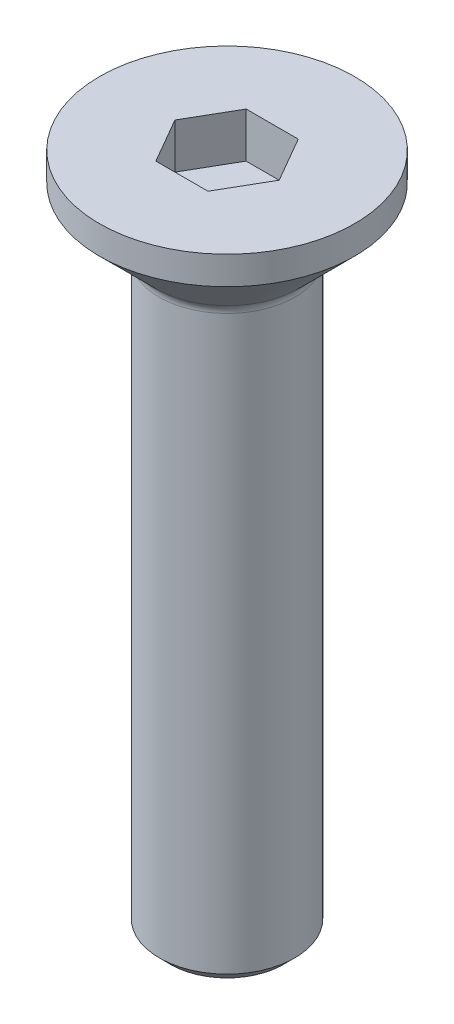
ISO-10303-21;
HEADER;
FILE_DESCRIPTION(('STEP AP214'),'2;1');
FILE_NAME('part.step','',(''),(''),'','','');
FILE_SCHEMA(('AUTOMOTIVE_DESIGN { 1 0 10303 214 1 1 1 1 }'));
ENDSEC;
DATA;
#1=APPLICATION_CONTEXT('core data for automotive mechanical design processes');
#2=APPLICATION_PROTOCOL_DEFINITION('international standard','automotive_design',2000,#1);
#3=PRODUCT_CONTEXT('',#1,'mechanical');
#4=PRODUCT('Part','Part','',(#3));
#5=PRODUCT_RELATED_PRODUCT_CATEGORY('part','',(#4));
#6=PRODUCT_DEFINITION_FORMATION('','',#4);
#7=PRODUCT_DEFINITION_CONTEXT('part definition',#1,'design');
#8=PRODUCT_DEFINITION('design','',#6,#7);
#9=PRODUCT_DEFINITION_SHAPE('','',#8);
#10=(LENGTH_UNIT() NAMED_UNIT(*) SI_UNIT(.MILLI.,.METRE.));
#11=(NAMED_UNIT(*) PLANE_ANGLE_UNIT() SI_UNIT($,.RADIAN.));
#12=(NAMED_UNIT(*) SI_UNIT($,.STERADIAN.) SOLID_ANGLE_UNIT());
#13=UNCERTAINTY_MEASURE_WITH_UNIT(LENGTH_MEASURE(1.E-05),#10,'distance_accuracy_value','');
#14=(GEOMETRIC_REPRESENTATION_CONTEXT(3) GLOBAL_UNCERTAINTY_ASSIGNED_CONTEXT((#13)) GLOBAL_UNIT_ASSIGNED_CONTEXT((#10,
#11,#12)) REPRESENTATION_CONTEXT('',''));
#15=CARTESIAN_POINT('',(0.,0.,0.));
#16=DIRECTION('',(0.,0.,1.));
#17=DIRECTION('',(1.,0.,0.));
#18=AXIS2_PLACEMENT_3D('',#15,#16,#17);
#19=CARTESIAN_POINT('',(0.,-4.14852813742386,0.));
#20=DIRECTION('',(0.,1.,0.));
#21=DIRECTION('',(-1.,0.,0.));
#22=AXIS2_PLACEMENT_3D('',#19,#20,#21);
#23=TOROIDAL_SURFACE('',#22,3.6,0.6);
#24=CARTESIAN_POINT('',(0.,-3.72426406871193,0.));
#25=DIRECTION('',(0.,1.,0.));
#26=DIRECTION('',(-1.,0.,0.));
#27=AXIS2_PLACEMENT_3D('',#24,#25,#26);
#28=CIRCLE('',#27,3.17573593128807);
#29=CARTESIAN_POINT('',(-3.17573593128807,-3.72426406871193,0.));
#30=VERTEX_POINT('',#29);
#31=EDGE_CURVE('E11',#30,#30,#28,.T.);
#32=ORIENTED_EDGE('',*,*,#31,.F.);
#33=EDGE_LOOP('',(#32));
#34=FACE_BOUND('',#33,.T.);
#35=CARTESIAN_POINT('',(0.,-4.14852813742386,0.));
#36=DIRECTION('',(0.,1.,0.));
#37=DIRECTION('',(-1.,0.,0.));
#38=AXIS2_PLACEMENT_3D('',#35,#36,#37);
#39=CIRCLE('',#38,3.);
#40=CARTESIAN_POINT('',(-3.,-4.14852813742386,0.));
#41=VERTEX_POINT('',#40);
#42=EDGE_CURVE('E138',#41,#41,#39,.T.);
#43=ORIENTED_EDGE('',*,*,#42,.T.);
#44=EDGE_LOOP('',(#43));
#45=FACE_BOUND('',#44,.T.);
#46=ADVANCED_FACE('F37',(#34,#45),#23,.F.);
#47=CARTESIAN_POINT('',(0.,-3.72426406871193,0.));
#48=DIRECTION('',(0.,1.,0.));
#49=DIRECTION('',(-1.,0.,0.));
#50=AXIS2_PLACEMENT_3D('',#47,#48,#49);
#51=CONICAL_SURFACE('',#50,3.17573593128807,0.78539816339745);
#52=CARTESIAN_POINT('',(0.,-1.25000000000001,0.));
#53=DIRECTION('',(0.,1.,0.));
#54=DIRECTION('',(-1.,0.,0.));
#55=AXIS2_PLACEMENT_3D('',#52,#53,#54);
#56=CIRCLE('',#55,5.65);
#57=CARTESIAN_POINT('',(-5.65,-1.25000000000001,0.));
#58=VERTEX_POINT('',#57);
#59=EDGE_CURVE('E44',#58,#58,#56,.T.);
#60=ORIENTED_EDGE('',*,*,#59,.F.);
#61=EDGE_LOOP('',(#60));
#62=FACE_BOUND('',#61,.T.);
#63=ORIENTED_EDGE('',*,*,#31,.T.);
#64=EDGE_LOOP('',(#63));
#65=FACE_BOUND('',#64,.T.);
#66=ADVANCED_FACE('F159',(#62,#65),#51,.T.);
#67=CARTESIAN_POINT('',(0.,0.,0.));
#68=DIRECTION('',(0.,1.,0.));
#69=DIRECTION('',(-1.,0.,0.));
#70=AXIS2_PLACEMENT_3D('',#67,#68,#69);
#71=CYLINDRICAL_SURFACE('',#70,5.65);
#72=CARTESIAN_POINT('',(0.,0.,0.));
#73=DIRECTION('',(0.,1.,0.));
#74=DIRECTION('',(-1.,0.,0.));
#75=AXIS2_PLACEMENT_3D('',#72,#73,#74);
#76=CIRCLE('',#75,5.65);
#77=CARTESIAN_POINT('',(-5.65,0.,0.));
#78=VERTEX_POINT('',#77);
#79=EDGE_CURVE('E152',#78,#78,#76,.T.);
#80=ORIENTED_EDGE('',*,*,#79,.F.);
#81=EDGE_LOOP('',(#80));
#82=FACE_BOUND('',#81,.T.);
#83=ORIENTED_EDGE('',*,*,#59,.T.);
#84=EDGE_LOOP('',(#83));
#85=FACE_BOUND('',#84,.T.);
#86=ADVANCED_FACE('F157',(#82,#85),#71,.T.);
#87=CARTESIAN_POINT('',(5.65,0.,0.));
#88=DIRECTION('',(0.,-1.,0.));
#89=DIRECTION('',(1.,0.,0.));
#90=AXIS2_PLACEMENT_3D('',#87,#88,#89);
#91=PLANE('',#90);
#92=DIRECTION('',(-0.5,0.,-0.866025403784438));
#93=VECTOR('',#92,1.);
#94=CARTESIAN_POINT('',(2.3094010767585,0.,0.));
#95=LINE('',#94,#93);
#96=CARTESIAN_POINT('',(2.3094010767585,0.,0.));
#97=VERTEX_POINT('',#96);
#98=CARTESIAN_POINT('',(1.15470053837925,0.,-2.));
#99=VERTEX_POINT('',#98);
#100=EDGE_CURVE('E125',#97,#99,#95,.T.);
#101=ORIENTED_EDGE('',*,*,#100,.F.);
#102=DIRECTION('',(0.5,0.,-0.866025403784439));
#103=VECTOR('',#102,1.);
#104=CARTESIAN_POINT('',(1.15470053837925,0.,2.));
#105=LINE('',#104,#103);
#106=CARTESIAN_POINT('',(1.15470053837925,0.,2.));
#107=VERTEX_POINT('',#106);
#108=EDGE_CURVE('E51',#107,#97,#105,.T.);
#109=ORIENTED_EDGE('',*,*,#108,.F.);
#110=DIRECTION('',(1.,0.,0.));
#111=VECTOR('',#110,1.);
#112=CARTESIAN_POINT('',(-1.15470053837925,0.,2.));
#113=LINE('',#112,#111);
#114=CARTESIAN_POINT('',(-1.15470053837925,0.,2.));
#115=VERTEX_POINT('',#114);
#116=EDGE_CURVE('E134',#115,#107,#113,.T.);
#117=ORIENTED_EDGE('',*,*,#116,.F.);
#118=DIRECTION('',(0.5,0.,0.866025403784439));
#119=VECTOR('',#118,1.);
#120=CARTESIAN_POINT('',(-2.3094010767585,0.,0.));
#121=LINE('',#120,#119);
#122=CARTESIAN_POINT('',(-2.3094010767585,0.,0.));
#123=VERTEX_POINT('',#122);
#124=EDGE_CURVE('E132',#123,#115,#121,.T.);
#125=ORIENTED_EDGE('',*,*,#124,.F.);
#126=DIRECTION('',(-0.5,0.,0.866025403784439));
#127=VECTOR('',#126,1.);
#128=CARTESIAN_POINT('',(-1.15470053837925,0.,-2.));
#129=LINE('',#128,#127);
#130=CARTESIAN_POINT('',(-1.15470053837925,0.,-2.));
#131=VERTEX_POINT('',#130);
#132=EDGE_CURVE('E99',#131,#123,#129,.T.);
#133=ORIENTED_EDGE('',*,*,#132,.F.);
#134=DIRECTION('',(-1.,0.,0.));
#135=VECTOR('',#134,1.);
#136=CARTESIAN_POINT('',(1.15470053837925,0.,-2.));
#137=LINE('',#136,#135);
#138=EDGE_CURVE('E128',#99,#131,#137,.T.);
#139=ORIENTED_EDGE('',*,*,#138,.F.);
#140=EDGE_LOOP('',(#101,#109,#117,#125,#133,#139));
#141=FACE_BOUND('',#140,.T.);
#142=ORIENTED_EDGE('',*,*,#79,.T.);
#143=EDGE_LOOP('',(#142));
#144=FACE_BOUND('',#143,.T.);
#145=ADVANCED_FACE('F183',(#141,#144),#91,.F.);
#146=CARTESIAN_POINT('',(2.5,-30.,0.));
#147=DIRECTION('',(0.,1.,0.));
#148=DIRECTION('',(-1.,0.,0.));
#149=AXIS2_PLACEMENT_3D('',#146,#147,#148);
#150=PLANE('',#149);
#151=CARTESIAN_POINT('',(0.,-30.,0.));
#152=DIRECTION('',(0.,1.,0.));
#153=DIRECTION('',(-1.,0.,0.));
#154=AXIS2_PLACEMENT_3D('',#151,#152,#153);
#155=CIRCLE('',#154,2.5);
#156=CARTESIAN_POINT('',(-2.5,-30.,0.));
#157=VERTEX_POINT('',#156);
#158=EDGE_CURVE('E149',#157,#157,#155,.T.);
#159=ORIENTED_EDGE('',*,*,#158,.F.);
#160=EDGE_LOOP('',(#159));
#161=FACE_BOUND('',#160,.T.);
#162=ADVANCED_FACE('F178',(#161),#150,.F.);
#163=CARTESIAN_POINT('',(0.,-30.,0.));
#164=DIRECTION('',(0.,1.,0.));
#165=DIRECTION('',(-1.,0.,0.));
#166=AXIS2_PLACEMENT_3D('',#163,#164,#165);
#167=CONICAL_SURFACE('',#166,2.5,0.785398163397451);
#168=CARTESIAN_POINT('',(0.,-29.5,0.));
#169=DIRECTION('',(0.,1.,0.));
#170=DIRECTION('',(-1.,0.,0.));
#171=AXIS2_PLACEMENT_3D('',#168,#169,#170);
#172=CIRCLE('',#171,3.);
#173=CARTESIAN_POINT('',(-3.,-29.5,0.));
#174=VERTEX_POINT('',#173);
#175=EDGE_CURVE('E146',#174,#174,#172,.T.);
#176=ORIENTED_EDGE('',*,*,#175,.F.);
#177=EDGE_LOOP('',(#176));
#178=FACE_BOUND('',#177,.T.);
#179=ORIENTED_EDGE('',*,*,#158,.T.);
#180=EDGE_LOOP('',(#179));
#181=FACE_BOUND('',#180,.T.);
#182=ADVANCED_FACE('F172',(#178,#181),#167,.T.);
#183=CARTESIAN_POINT('',(0.,0.,0.));
#184=DIRECTION('',(0.,1.,0.));
#185=DIRECTION('',(-1.,0.,0.));
#186=AXIS2_PLACEMENT_3D('',#183,#184,#185);
#187=CYLINDRICAL_SURFACE('',#186,3.);
#188=ORIENTED_EDGE('',*,*,#42,.F.);
#189=EDGE_LOOP('',(#188));
#190=FACE_BOUND('',#189,.T.);
#191=ORIENTED_EDGE('',*,*,#175,.T.);
#192=EDGE_LOOP('',(#191));
#193=FACE_BOUND('',#192,.T.);
#194=ADVANCED_FACE('F168',(#190,#193),#187,.T.);
#195=CARTESIAN_POINT('',(1.15470053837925,-2.,2.));
#196=DIRECTION('',(0.866025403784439,0.,0.5));
#197=DIRECTION('',(0.5,0.,-0.866025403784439));
#198=AXIS2_PLACEMENT_3D('',#195,#196,#197);
#199=PLANE('',#198);
#200=ORIENTED_EDGE('',*,*,#108,.T.);
#201=DIRECTION('',(0.,1.,0.));
#202=VECTOR('',#201,1.);
#203=CARTESIAN_POINT('',(2.3094010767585,-2.,0.));
#204=LINE('',#203,#202);
#205=CARTESIAN_POINT('',(2.3094010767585,-2.,0.));
#206=VERTEX_POINT('',#205);
#207=EDGE_CURVE('E81',#206,#97,#204,.T.);
#208=ORIENTED_EDGE('',*,*,#207,.F.);
#209=DIRECTION('',(0.5,0.,-0.866025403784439));
#210=VECTOR('',#209,1.);
#211=CARTESIAN_POINT('',(1.15470053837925,-2.,2.));
#212=LINE('',#211,#210);
#213=CARTESIAN_POINT('',(1.15470053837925,-2.,2.));
#214=VERTEX_POINT('',#213);
#215=EDGE_CURVE('E136',#214,#206,#212,.T.);
#216=ORIENTED_EDGE('',*,*,#215,.F.);
#217=DIRECTION('',(0.,1.,0.));
#218=VECTOR('',#217,1.);
#219=CARTESIAN_POINT('',(1.15470053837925,-2.,2.));
#220=LINE('',#219,#218);
#221=EDGE_CURVE('E59',#214,#107,#220,.T.);
#222=ORIENTED_EDGE('',*,*,#221,.T.);
#223=EDGE_LOOP('',(#200,#208,#216,#222));
#224=FACE_BOUND('',#223,.T.);
#225=ADVANCED_FACE('F171',(#224),#199,.F.);
#226=CARTESIAN_POINT('',(-1.15470053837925,-2.,2.));
#227=DIRECTION('',(0.,0.,1.));
#228=DIRECTION('',(1.,0.,0.));
#229=AXIS2_PLACEMENT_3D('',#226,#227,#228);
#230=PLANE('',#229);
#231=ORIENTED_EDGE('',*,*,#116,.T.);
#232=ORIENTED_EDGE('',*,*,#221,.F.);
#233=DIRECTION('',(1.,0.,0.));
#234=VECTOR('',#233,1.);
#235=CARTESIAN_POINT('',(-1.15470053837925,-2.,2.));
#236=LINE('',#235,#234);
#237=CARTESIAN_POINT('',(-1.15470053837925,-2.,2.));
#238=VERTEX_POINT('',#237);
#239=EDGE_CURVE('E111',#238,#214,#236,.T.);
#240=ORIENTED_EDGE('',*,*,#239,.F.);
#241=DIRECTION('',(0.,1.,0.));
#242=VECTOR('',#241,1.);
#243=CARTESIAN_POINT('',(-1.15470053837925,-2.,2.));
#244=LINE('',#243,#242);
#245=EDGE_CURVE('E103',#238,#115,#244,.T.);
#246=ORIENTED_EDGE('',*,*,#245,.T.);
#247=EDGE_LOOP('',(#231,#232,#240,#246));
#248=FACE_BOUND('',#247,.T.);
#249=ADVANCED_FACE('F218',(#248),#230,.F.);
#250=CARTESIAN_POINT('',(-2.3094010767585,-2.,0.));
#251=DIRECTION('',(-0.866025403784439,0.,0.5));
#252=DIRECTION('',(0.5,0.,0.866025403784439));
#253=AXIS2_PLACEMENT_3D('',#250,#251,#252);
#254=PLANE('',#253);
#255=ORIENTED_EDGE('',*,*,#124,.T.);
#256=ORIENTED_EDGE('',*,*,#245,.F.);
#257=DIRECTION('',(0.5,0.,0.866025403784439));
#258=VECTOR('',#257,1.);
#259=CARTESIAN_POINT('',(-2.3094010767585,-2.,0.));
#260=LINE('',#259,#258);
#261=CARTESIAN_POINT('',(-2.3094010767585,-2.,0.));
#262=VERTEX_POINT('',#261);
#263=EDGE_CURVE('E107',#262,#238,#260,.T.);
#264=ORIENTED_EDGE('',*,*,#263,.F.);
#265=DIRECTION('',(0.,1.,0.));
#266=VECTOR('',#265,1.);
#267=CARTESIAN_POINT('',(-2.3094010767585,-2.,0.));
#268=LINE('',#267,#266);
#269=EDGE_CURVE('E92',#262,#123,#268,.T.);
#270=ORIENTED_EDGE('',*,*,#269,.T.);
#271=EDGE_LOOP('',(#255,#256,#264,#270));
#272=FACE_BOUND('',#271,.T.);
#273=ADVANCED_FACE('F108',(#272),#254,.F.);
#274=CARTESIAN_POINT('',(-1.15470053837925,-2.,-2.));
#275=DIRECTION('',(-0.866025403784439,0.,-0.5));
#276=DIRECTION('',(-0.5,0.,0.866025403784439));
#277=AXIS2_PLACEMENT_3D('',#274,#275,#276);
#278=PLANE('',#277);
#279=ORIENTED_EDGE('',*,*,#132,.T.);
#280=ORIENTED_EDGE('',*,*,#269,.F.);
#281=DIRECTION('',(-0.5,0.,0.866025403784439));
#282=VECTOR('',#281,1.);
#283=CARTESIAN_POINT('',(-1.15470053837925,-2.,-2.));
#284=LINE('',#283,#282);
#285=CARTESIAN_POINT('',(-1.15470053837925,-2.,-2.));
#286=VERTEX_POINT('',#285);
#287=EDGE_CURVE('E96',#286,#262,#284,.T.);
#288=ORIENTED_EDGE('',*,*,#287,.F.);
#289=DIRECTION('',(0.,1.,0.));
#290=VECTOR('',#289,1.);
#291=CARTESIAN_POINT('',(-1.15470053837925,-2.,-2.));
#292=LINE('',#291,#290);
#293=EDGE_CURVE('E104',#286,#131,#292,.T.);
#294=ORIENTED_EDGE('',*,*,#293,.T.);
#295=EDGE_LOOP('',(#279,#280,#288,#294));
#296=FACE_BOUND('',#295,.T.);
#297=ADVANCED_FACE('F94',(#296),#278,.F.);
#298=CARTESIAN_POINT('',(1.15470053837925,-2.,-2.));
#299=DIRECTION('',(0.,0.,-1.));
#300=DIRECTION('',(-1.,0.,0.));
#301=AXIS2_PLACEMENT_3D('',#298,#299,#300);
#302=PLANE('',#301);
#303=ORIENTED_EDGE('',*,*,#138,.T.);
#304=ORIENTED_EDGE('',*,*,#293,.F.);
#305=DIRECTION('',(-1.,0.,0.));
#306=VECTOR('',#305,1.);
#307=CARTESIAN_POINT('',(1.15470053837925,-2.,-2.));
#308=LINE('',#307,#306);
#309=CARTESIAN_POINT('',(1.15470053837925,-2.,-2.));
#310=VERTEX_POINT('',#309);
#311=EDGE_CURVE('E117',#310,#286,#308,.T.);
#312=ORIENTED_EDGE('',*,*,#311,.F.);
#313=DIRECTION('',(0.,1.,0.));
#314=VECTOR('',#313,1.);
#315=CARTESIAN_POINT('',(1.15470053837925,-2.,-2.));
#316=LINE('',#315,#314);
#317=EDGE_CURVE('E141',#310,#99,#316,.T.);
#318=ORIENTED_EDGE('',*,*,#317,.T.);
#319=EDGE_LOOP('',(#303,#304,#312,#318));
#320=FACE_BOUND('',#319,.T.);
#321=ADVANCED_FACE('F243',(#320),#302,.F.);
#322=CARTESIAN_POINT('',(2.3094010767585,-2.,0.));
#323=DIRECTION('',(0.866025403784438,0.,-0.5));
#324=DIRECTION('',(-0.5,0.,-0.866025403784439));
#325=AXIS2_PLACEMENT_3D('',#322,#323,#324);
#326=PLANE('',#325);
#327=ORIENTED_EDGE('',*,*,#100,.T.);
#328=ORIENTED_EDGE('',*,*,#317,.F.);
#329=DIRECTION('',(-0.5,0.,-0.866025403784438));
#330=VECTOR('',#329,1.);
#331=CARTESIAN_POINT('',(2.3094010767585,-2.,0.));
#332=LINE('',#331,#330);
#333=EDGE_CURVE('E119',#206,#310,#332,.T.);
#334=ORIENTED_EDGE('',*,*,#333,.F.);
#335=ORIENTED_EDGE('',*,*,#207,.T.);
#336=EDGE_LOOP('',(#327,#328,#334,#335));
#337=FACE_BOUND('',#336,.T.);
#338=ADVANCED_FACE('F252',(#337),#326,.F.);
#339=CARTESIAN_POINT('',(1.15470053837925,-2.,2.));
#340=DIRECTION('',(0.,-1.,0.));
#341=DIRECTION('',(1.,0.,0.));
#342=AXIS2_PLACEMENT_3D('',#339,#340,#341);
#343=PLANE('',#342);
#344=ORIENTED_EDGE('',*,*,#215,.T.);
#345=ORIENTED_EDGE('',*,*,#333,.T.);
#346=ORIENTED_EDGE('',*,*,#311,.T.);
#347=ORIENTED_EDGE('',*,*,#287,.T.);
#348=ORIENTED_EDGE('',*,*,#263,.T.);
#349=ORIENTED_EDGE('',*,*,#239,.T.);
#350=EDGE_LOOP('',(#344,#345,#346,#347,#348,#349));
#351=FACE_BOUND('',#350,.T.);
#352=ADVANCED_FACE('F114',(#351),#343,.F.);
#353=CLOSED_SHELL('',(#46,#66,#86,#145,#162,#182,#194,#225,#249,#273,#297,#321,#338,#352));
#354=MANIFOLD_SOLID_BREP('B2',#353);
#355=ADVANCED_BREP_SHAPE_REPRESENTATION('',(#18,#354),#14);
#356=SHAPE_DEFINITION_REPRESENTATION(#9,#355);
ENDSEC;
END-ISO-10303-21;
